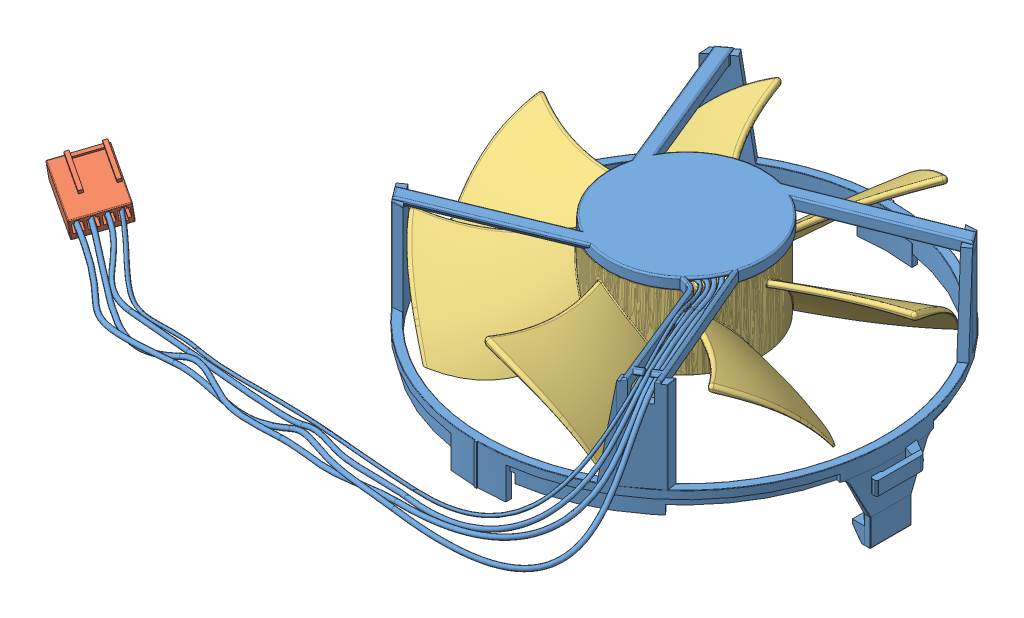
SolidWorks assembly Assem2.SLDASM, configuration Default (file format 10000). Lengths in mm.
Overall size (136.4 39.35 125.58).
3 component instances, 3 part files, 2 mates.
Components (placement in the parent):
- armação ventoinha-1: armação ventoinha.SLDPRT [Default] at (-4.6574 67.1845 100.9119) size (123.03 39.35 120.8)
- ficha-1: ficha.SLDPRT [Default] at (-83.5513 84.6997 147.059) x (0.513554 0.17666 -0.839674) z (0.843743 -0.281965 0.45672) size (10.5 5.85 12.5)
- ventoinha-1: ventoinha.SLDPRT [Default] at (-4.6574 72.1645 100.9119) x (0.127574 0 0.991829) z (-0.991829 0 0.127574) size (90.92 21.52 91.2)
Mates (geometry in assembly coordinates):
- Concentric1: concentric aligned: cylinder of armação ventoinha-1 through (-4.6574 76.5645 100.9119) axis (0 1 0) radius 7; cylinder of ventoinha-1 through (-4.6574 76.5645 100.9119) axis (0 1 0) radius 7
- Coincident1: coincident anti-aligned: plane of armação ventoinha-1 through (-4.6574 76.5645 100.9119) normal (0 -1 0); plane of ventoinha-1 through (-4.6574 76.5645 100.9119) normal (0 1 0)
